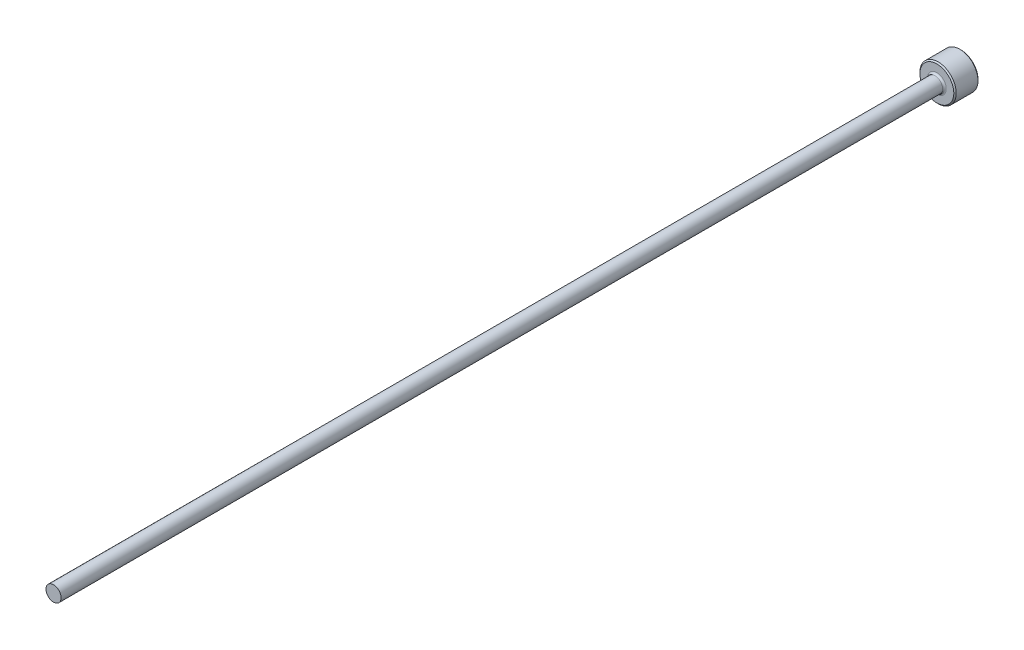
from build123d import *

# Parameters (mm, degrees)
CHAMFER1_SIZE = 0.2


with BuildPart() as part:
    # Sketch1 → Revolve1 (revolve)
    with BuildSketch(Plane(origin=(0, 0, 0), x_dir=(0, 0, -1), z_dir=(1, 0, 0)), mode=Mode.PRIVATE) as revolve1_sk:
        with BuildLine():
            Line((0, 0), (0, 3))
            Line((0, 3), (-4, 3))
            Line((-4, 3), (-4, 1.55))
            ThreePointArc((-4, 1.55), (-4.087867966, 1.337867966), (-4.3, 1.25))
            Line((-4.3, 1.25), (-150, 1.25))
            Line((-150, 1.25), (-150, 0))
            Line((-150, 0), (0, 0))
        make_face()
    revolve(revolve1_sk.sketch.rotate(Axis((0, 0, 109.05062828), (0, 0, -1)), 90), axis=Axis((0, 0, 109.05062828), (0, 0, -1)))

    # Chamfer1
    chamfer1_edges = [part.edges().sort_by_distance(p)[0] for p in [
        (-3, 0, 0),
        (-3, 0, 4),
    ]]
    chamfer(chamfer1_edges, length=CHAMFER1_SIZE)


solid = part.part
